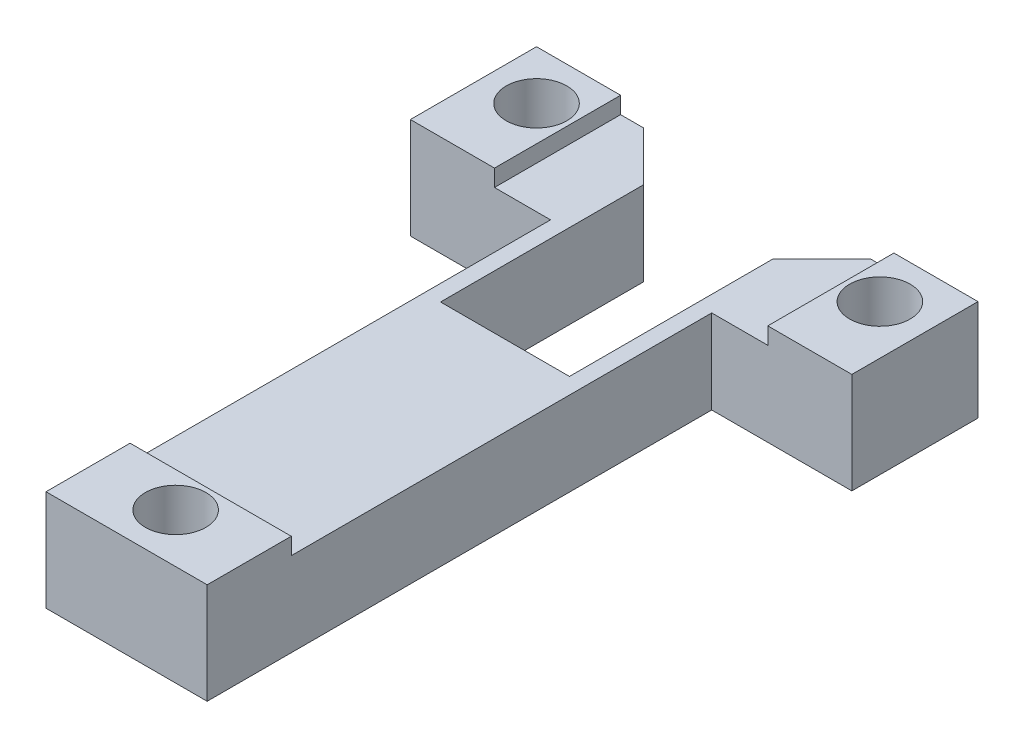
from build123d import *

# Parameters (mm, degrees)
BOSS_EXTRUDE1_DEPTH     = 6
SKETCH3_W               = 6
SKETCH3_H               = 9
SKETCH3_W_2             = 11.5
SKETCH3_H_2             = 6
BOSS_EXTRUDE2_DEPTH     = 1.2
CUT_EXTRUDE1_DEPTH      = 51.231961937
CUT_EXTRUDE1_DEPTH_BACK = 11
SKETCH2_R               = 2.16


with BuildPart() as part:
    # Sketch1 → Boss-Extrude1 (new body)
    with BuildSketch(Plane(origin=(0, 0, 0), x_dir=(1, 0, 0), z_dir=(0, 1, 0))):
        Polygon((11.5, 0), (11.5, 36), (21.5, 36), (21.5, 45), (-10, 45), (-10, 36), (0, 36), (0, 0), align=None)
    extrude(amount=BOSS_EXTRUDE1_DEPTH)

    # Sketch3 → Boss-Extrude2 (add)
    with BuildSketch(Plane(origin=(0, 6, 0), x_dir=(1, 0, 0), z_dir=(0, 1, 0))):
        with Locations((-7, 40.5)):
            Rectangle(SKETCH3_W, SKETCH3_H)
        with Locations((18.5, 40.5)):
            Rectangle(SKETCH3_W, SKETCH3_H)
        with Locations((5.75, 3)):
            Rectangle(SKETCH3_W_2, SKETCH3_H_2)
    extrude(amount=BOSS_EXTRUDE2_DEPTH)

    # Sketch2 → Cut-Extrude1 (cut, two sides: drawn at the far end of the back side and taken through both)
    with BuildSketch(Plane(origin=(0, 6, 0), x_dir=(1, 0, 0), z_dir=(0, 1, 0)).offset(-CUT_EXTRUDE1_DEPTH_BACK)):
        Polygon((1.15, 41.5), (1.15, 27), (5.75, 27), (10.35, 27), (10.35, 41.5), (13.85, 45), (-2.35, 45), align=None)
        with Locations(Location((5.75, 3.5, 0), (0, 0, 270))):
            Circle(SKETCH2_R)
        with Locations(Location((-6.5, 41.5, 0), (0, 0, 270))):
            Circle(SKETCH2_R)
        with Locations(Location((18, 41.5, 0), (0, 0, 270))):
            Circle(SKETCH2_R)
    extrude(amount=CUT_EXTRUDE1_DEPTH + CUT_EXTRUDE1_DEPTH_BACK, mode=Mode.SUBTRACT)


solid = part.part
